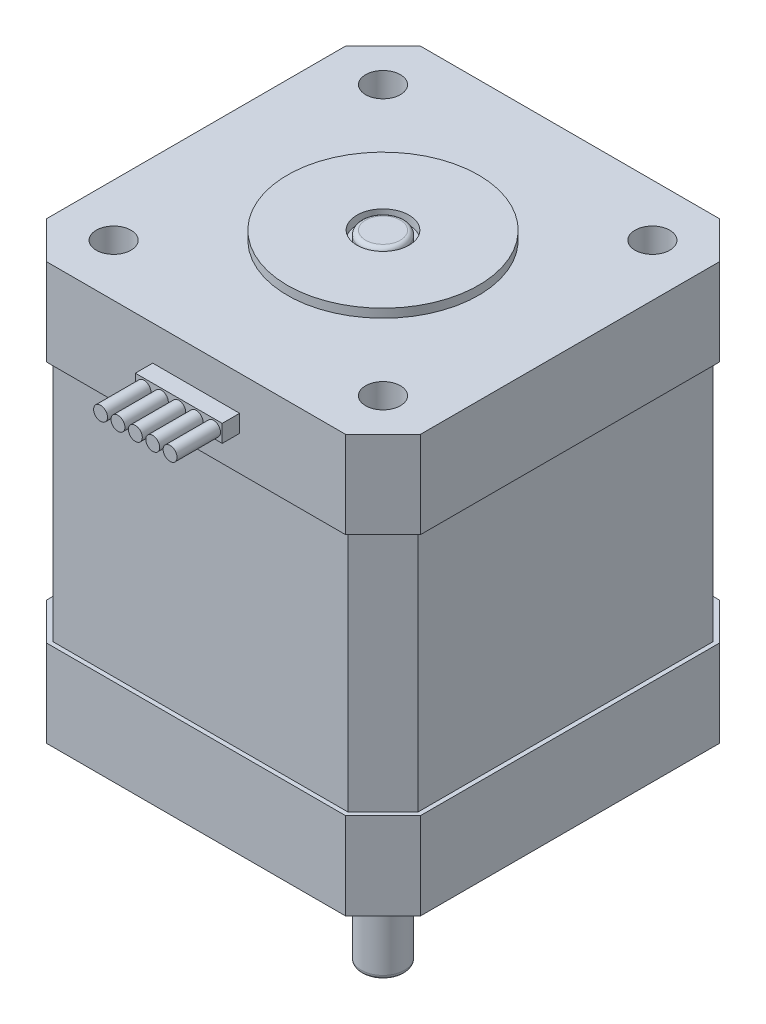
from build123d import *

# Parameters (mm, degrees)
SKETCH2_W            = 42
SKETCH2_H            = 42
BOSS_EXTRUDE1_DEPTH  = 48
SKETCH14_R           = 2
CUT_EXTRUDE3_DEPTH   = 4.5
CUT_EXTRUDE2_START   = -4.5
SKETCH13_R           = 2
CUT_EXTRUDE2_DEPTH   = 4.5
CUT_EXTRUDE1_DEPTH   = 48
BOSS_EXTRUDE2_DEPTH  = 10
BOSS_EXTRUDE3_DEPTH  = 10
SKETCH6_R            = 11
SKETCH6_R_2          = 3
SKETCH6_R_3          = 2.5
BOSS_EXTRUDE4_DEPTH  = 1
BOSS_EXTRUDE5_START  = 2
SKETCH7_R            = 11
BOSS_EXTRUDE5_DEPTH  = 2
BOSS_EXTRUDE6_START  = 22
SKETCH8_R            = 2.5
BOSS_EXTRUDE6_DEPTH  = 22
FILLET1_R            = 0.5
FILLET2_R            = 0.5
SKETCH9_W            = 10
SKETCH9_H            = 2
BOSS_EXTRUDE7_DEPTH  = 2
SKETCH11_R           = 0.8
BOSS_EXTRUDE10_DEPTH = 5


with BuildPart() as part:
    # Sketch2 → Boss-Extrude1 (new body)
    with BuildSketch(Plane(origin=(0, 0, 0), x_dir=(1, 0, 0), z_dir=(0, 1, 0))):
        Rectangle(SKETCH2_W, SKETCH2_H)
    extrude(amount=-BOSS_EXTRUDE1_DEPTH)

    # Sketch14 → Cut-Extrude3 (cut)
    with BuildSketch(Plane.XZ.offset(48)):
        with Locations(Location((-15.5, 15.5, 0), (0, 0, 270))):
            Circle(SKETCH14_R)
        with Locations(Location((-15.5, -15.5, 0), (0, 0, 90))):
            Circle(SKETCH14_R)
        with Locations(Location((15.5, -15.5, 0), (0, 0, 270))):
            Circle(SKETCH14_R)
        with Locations(Location((15.5, 15.5, 0), (0, 0, 90))):
            Circle(SKETCH14_R)
    extrude(amount=-CUT_EXTRUDE3_DEPTH, mode=Mode.SUBTRACT)

    # Sketch13 → Cut-Extrude2 (cut)
    with BuildSketch(Plane(origin=(0, 0, 0), x_dir=(1, 0, 0), z_dir=(0, 1, 0)).offset(CUT_EXTRUDE2_START)):
        with Locations(Location((-15.5, 15.5, 0), (0, 0, 270))):
            Circle(SKETCH13_R)
        with Locations(Location((15.5, 15.5, 0), (0, 0, 90))):
            Circle(SKETCH13_R)
        with Locations(Location((15.5, -15.5, 0), (0, 0, 270))):
            Circle(SKETCH13_R)
        with Locations(Location((-15.5, -15.5, 0), (0, 0, 90))):
            Circle(SKETCH13_R)
    extrude(amount=CUT_EXTRUDE2_DEPTH, mode=Mode.SUBTRACT)

    # Sketch3 → Cut-Extrude1 (cut)
    with BuildSketch(Plane(origin=(0, 0, 0), x_dir=(1, 0, 0), z_dir=(0, 1, 0))):
        Polygon((-21, 21), (-17, 21), (-21, 17), align=None)
        Polygon((-21, -21), (-21, -17), (-17, -21), align=None)
        Polygon((21, -21), (17, -21), (21, -17), align=None)
        Polygon((21, 21), (21, 17), (17, 21), align=None)
    extrude(amount=-CUT_EXTRUDE1_DEPTH, mode=Mode.SUBTRACT)

    # Sketch4 → Boss-Extrude2 (add)
    with BuildSketch(Plane.XZ.offset(48)):
        Polygon((-21.5, 17.207106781), (-17.207106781, 21.5), (17.207106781, 21.5), (21.5, 17.207106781), (21.5, -17.207106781), (17.207106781, -21.5), (-17.207106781, -21.5), (-21.5, -17.207106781), align=None)
        Polygon((-17, 21), (17, 21), (21, 17), (21, -17), (17, -21), (-17, -21), (-21, -17), (-21, 17), align=None, mode=Mode.SUBTRACT)
    extrude(amount=-BOSS_EXTRUDE2_DEPTH)

    # Sketch5 → Boss-Extrude3 (add)
    with BuildSketch(Plane(origin=(0, 0, 0), x_dir=(1, 0, 0), z_dir=(0, 1, 0))):
        Polygon((-21.5, 17.207106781), (-17.207106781, 21.5), (17.207106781, 21.5), (21.5, 17.207106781), (21.5, -17.207106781), (17.207106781, -21.5), (-17.207106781, -21.5), (-21.5, -17.207106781), align=None)
        Polygon((-17, 21), (17, 21), (21, 17), (21, -17), (17, -21), (-17, -21), (-21, -17), (-21, 17), align=None, mode=Mode.SUBTRACT)
    extrude(amount=-BOSS_EXTRUDE3_DEPTH)

    # Sketch6 → Boss-Extrude4 (add)
    # profile 1 of 2: a face of its own
    with BuildSketch(Plane(origin=(0, 0, 0), x_dir=(1, 0, 0), z_dir=(0, 1, 0))):
        with Locations(Location((0, 0, 0), (0, 0, 90))):
            Circle(SKETCH6_R)
        with Locations(Location((0, 0, 0), (0, 0, 270))):
            Circle(SKETCH6_R_2, mode=Mode.SUBTRACT)
    # profile 2 of 2: a face of its own
    with BuildSketch(Plane(origin=(0, 0, 0), x_dir=(1, 0, 0), z_dir=(0, 1, 0))):
        with Locations(Location((0, 0, 0), (0, 0, 90))):
            Circle(SKETCH6_R_3)
    extrude(amount=BOSS_EXTRUDE4_DEPTH)

    # Sketch7 → Boss-Extrude5 (add)
    with BuildSketch(Plane.XZ.offset(48).offset(BOSS_EXTRUDE5_START)):
        with Locations(Location((0, 0, 0), (0, 0, 270))):
            Circle(SKETCH7_R)
    extrude(amount=-BOSS_EXTRUDE5_DEPTH)

    # Sketch8 → Boss-Extrude6 (add)
    with BuildSketch(Plane.XZ.offset(50).offset(BOSS_EXTRUDE6_START)):
        with Locations(Location((0, 0, 0), (0, 0, 270))):
            Circle(SKETCH8_R)
    extrude(amount=-BOSS_EXTRUDE6_DEPTH)

    # Fillet1
    fillet1_edges = [part.edges().sort_by_distance(p)[0] for p in [
        (0, -72, 2.5),
    ]]
    fillet(fillet1_edges, radius=FILLET1_R)

    # Fillet2
    fillet2_edges = [part.edges().sort_by_distance(p)[0] for p in [
        (0, 1, 2.5),
    ]]
    fillet(fillet2_edges, radius=FILLET2_R)

    # Sketch9 → Boss-Extrude7 (add)
    with BuildSketch(Plane.XY.offset(21.5)):
        with Locations((0, -5)):
            Rectangle(SKETCH9_W, SKETCH9_H)
    extrude(amount=BOSS_EXTRUDE7_DEPTH)

    # Sketch11 → Boss-Extrude10 (add)
    with BuildSketch(Plane.XY.offset(23.5)):
        with Locations(Location((-4, -5, 0), (0, 0, 180))):
            Circle(SKETCH11_R)
        with Locations(Location((-2, -5, 0), (0, 0, 180))):
            Circle(SKETCH11_R)
        with Locations(Location((0, -5, 0), (0, 0, 180))):
            Circle(SKETCH11_R)
        with Locations(Location((2, -5, 0), (0, 0, 180))):
            Circle(SKETCH11_R)
        with Locations(Location((4, -5, 0), (0, 0, 180))):
            Circle(SKETCH11_R)
    extrude(amount=BOSS_EXTRUDE10_DEPTH)


solid = part.part
